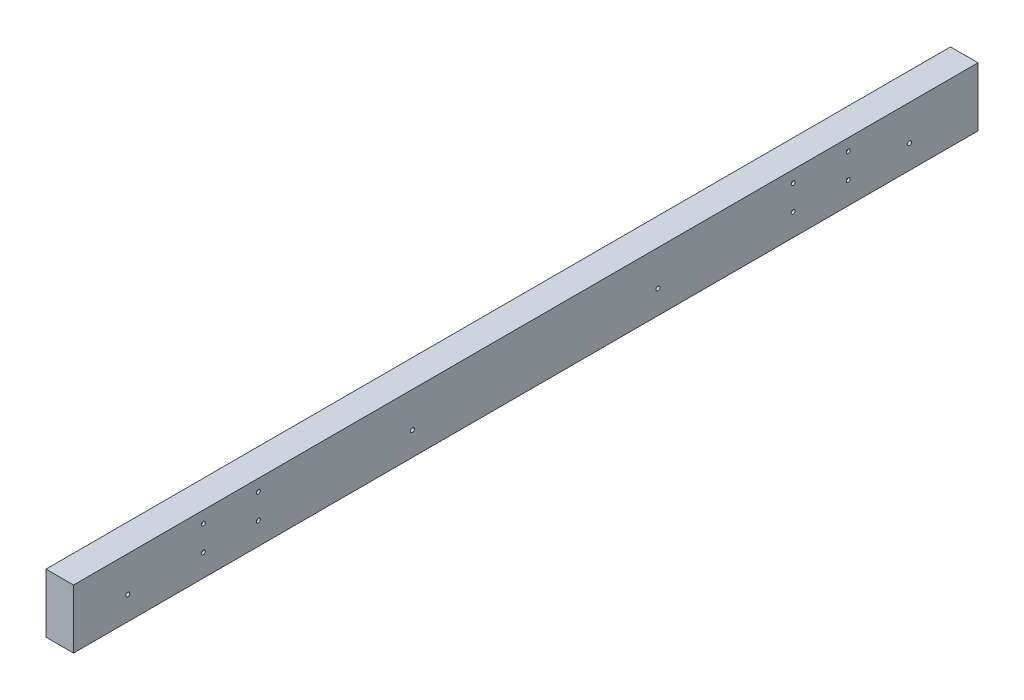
ISO-10303-21;
HEADER;
FILE_DESCRIPTION(('STEP AP214'),'2;1');
FILE_NAME('part.step','',(''),(''),'','','');
FILE_SCHEMA(('AUTOMOTIVE_DESIGN { 1 0 10303 214 1 1 1 1 }'));
ENDSEC;
DATA;
#1=APPLICATION_CONTEXT('core data for automotive mechanical design processes');
#2=APPLICATION_PROTOCOL_DEFINITION('international standard','automotive_design',2000,#1);
#3=PRODUCT_CONTEXT('',#1,'mechanical');
#4=PRODUCT('Part','Part','',(#3));
#5=PRODUCT_RELATED_PRODUCT_CATEGORY('part','',(#4));
#6=PRODUCT_DEFINITION_FORMATION('','',#4);
#7=PRODUCT_DEFINITION_CONTEXT('part definition',#1,'design');
#8=PRODUCT_DEFINITION('design','',#6,#7);
#9=PRODUCT_DEFINITION_SHAPE('','',#8);
#10=(LENGTH_UNIT() NAMED_UNIT(*) SI_UNIT(.MILLI.,.METRE.));
#11=(NAMED_UNIT(*) PLANE_ANGLE_UNIT() SI_UNIT($,.RADIAN.));
#12=(NAMED_UNIT(*) SI_UNIT($,.STERADIAN.) SOLID_ANGLE_UNIT());
#13=UNCERTAINTY_MEASURE_WITH_UNIT(LENGTH_MEASURE(1.E-05),#10,'distance_accuracy_value','');
#14=(GEOMETRIC_REPRESENTATION_CONTEXT(3) GLOBAL_UNCERTAINTY_ASSIGNED_CONTEXT((#13)) GLOBAL_UNIT_ASSIGNED_CONTEXT((#10,
#11,#12)) REPRESENTATION_CONTEXT('',''));
#15=CARTESIAN_POINT('',(0.,0.,0.));
#16=DIRECTION('',(0.,0.,1.));
#17=DIRECTION('',(1.,0.,0.));
#18=AXIS2_PLACEMENT_3D('',#15,#16,#17);
#19=CARTESIAN_POINT('',(-1.524,2.23221198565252,-483.155377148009));
#20=DIRECTION('',(1.,0.,0.));
#21=DIRECTION('',(0.,0.,-1.));
#22=AXIS2_PLACEMENT_3D('',#19,#20,#21);
#23=PLANE('',#22);
#24=CARTESIAN_POINT('',(-1.524,2.23221198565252,-483.155377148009));
#25=DIRECTION('',(1.,0.,0.));
#26=DIRECTION('',(0.,0.,-1.));
#27=AXIS2_PLACEMENT_3D('',#24,#25,#26);
#28=CIRCLE('',#27,1.27000000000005);
#29=CARTESIAN_POINT('',(-1.524,2.23221198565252,-484.425377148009));
#30=VERTEX_POINT('',#29);
#31=EDGE_CURVE('E17',#30,#30,#28,.T.);
#32=ORIENTED_EDGE('',*,*,#31,.T.);
#33=EDGE_LOOP('',(#32));
#34=FACE_BOUND('',#33,.T.);
#35=ADVANCED_FACE('F14',(#34),#23,.T.);
#36=CARTESIAN_POINT('',(-1.524,-13.8205880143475,-483.155377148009));
#37=DIRECTION('',(1.,0.,0.));
#38=DIRECTION('',(0.,0.,-1.));
#39=AXIS2_PLACEMENT_3D('',#36,#37,#38);
#40=PLANE('',#39);
#41=CARTESIAN_POINT('',(-1.524,-13.8205880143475,-483.155377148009));
#42=DIRECTION('',(1.,0.,0.));
#43=DIRECTION('',(0.,0.,-1.));
#44=AXIS2_PLACEMENT_3D('',#41,#42,#43);
#45=CIRCLE('',#44,1.27000000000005);
#46=CARTESIAN_POINT('',(-1.524,-13.8205880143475,-484.425377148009));
#47=VERTEX_POINT('',#46);
#48=EDGE_CURVE('E151',#47,#47,#45,.T.);
#49=ORIENTED_EDGE('',*,*,#48,.T.);
#50=EDGE_LOOP('',(#49));
#51=FACE_BOUND('',#50,.T.);
#52=ADVANCED_FACE('F244',(#51),#40,.T.);
#53=CARTESIAN_POINT('',(-1.524,2.23221198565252,-518.715377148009));
#54=DIRECTION('',(1.,0.,0.));
#55=DIRECTION('',(0.,0.,-1.));
#56=AXIS2_PLACEMENT_3D('',#53,#54,#55);
#57=PLANE('',#56);
#58=CARTESIAN_POINT('',(-1.524,2.23221198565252,-518.715377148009));
#59=DIRECTION('',(1.,0.,0.));
#60=DIRECTION('',(0.,0.,-1.));
#61=AXIS2_PLACEMENT_3D('',#58,#59,#60);
#62=CIRCLE('',#61,1.26999999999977);
#63=CARTESIAN_POINT('',(-1.524,2.23221198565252,-519.985377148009));
#64=VERTEX_POINT('',#63);
#65=EDGE_CURVE('E149',#64,#64,#62,.T.);
#66=ORIENTED_EDGE('',*,*,#65,.T.);
#67=EDGE_LOOP('',(#66));
#68=FACE_BOUND('',#67,.T.);
#69=ADVANCED_FACE('F241',(#68),#57,.T.);
#70=CARTESIAN_POINT('',(-1.524,-13.8205880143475,-518.715377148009));
#71=DIRECTION('',(1.,0.,0.));
#72=DIRECTION('',(0.,0.,-1.));
#73=AXIS2_PLACEMENT_3D('',#70,#71,#72);
#74=PLANE('',#73);
#75=CARTESIAN_POINT('',(-1.524,-13.8205880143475,-518.715377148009));
#76=DIRECTION('',(1.,0.,0.));
#77=DIRECTION('',(0.,0.,-1.));
#78=AXIS2_PLACEMENT_3D('',#75,#76,#77);
#79=CIRCLE('',#78,1.26999999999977);
#80=CARTESIAN_POINT('',(-1.524,-13.8205880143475,-519.985377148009));
#81=VERTEX_POINT('',#80);
#82=EDGE_CURVE('E146',#81,#81,#79,.T.);
#83=ORIENTED_EDGE('',*,*,#82,.T.);
#84=EDGE_LOOP('',(#83));
#85=FACE_BOUND('',#84,.T.);
#86=ADVANCED_FACE('F243',(#85),#74,.T.);
#87=CARTESIAN_POINT('',(-1.524,-13.8205880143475,-102.155377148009));
#88=DIRECTION('',(-1.,0.,0.));
#89=DIRECTION('',(0.,0.,1.));
#90=AXIS2_PLACEMENT_3D('',#87,#88,#89);
#91=PLANE('',#90);
#92=CARTESIAN_POINT('',(-1.524,-13.8205880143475,-102.155377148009));
#93=DIRECTION('',(1.,0.,0.));
#94=DIRECTION('',(0.,0.,-1.));
#95=AXIS2_PLACEMENT_3D('',#92,#93,#94);
#96=CIRCLE('',#95,1.27000000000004);
#97=CARTESIAN_POINT('',(-1.524,-13.8205880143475,-103.425377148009));
#98=VERTEX_POINT('',#97);
#99=EDGE_CURVE('E143',#98,#98,#96,.T.);
#100=ORIENTED_EDGE('',*,*,#99,.T.);
#101=EDGE_LOOP('',(#100));
#102=FACE_BOUND('',#101,.T.);
#103=ADVANCED_FACE('F250',(#102),#91,.F.);
#104=CARTESIAN_POINT('',(-1.524,2.23221198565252,-102.155377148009));
#105=DIRECTION('',(-1.,0.,0.));
#106=DIRECTION('',(0.,0.,1.));
#107=AXIS2_PLACEMENT_3D('',#104,#105,#106);
#108=PLANE('',#107);
#109=CARTESIAN_POINT('',(-1.524,2.23221198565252,-102.155377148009));
#110=DIRECTION('',(1.,0.,0.));
#111=DIRECTION('',(0.,0.,-1.));
#112=AXIS2_PLACEMENT_3D('',#109,#110,#111);
#113=CIRCLE('',#112,1.27000000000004);
#114=CARTESIAN_POINT('',(-1.524,2.23221198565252,-103.425377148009));
#115=VERTEX_POINT('',#114);
#116=EDGE_CURVE('E140',#115,#115,#113,.T.);
#117=ORIENTED_EDGE('',*,*,#116,.T.);
#118=EDGE_LOOP('',(#117));
#119=FACE_BOUND('',#118,.T.);
#120=ADVANCED_FACE('F256',(#119),#108,.F.);
#121=CARTESIAN_POINT('',(-1.524,-13.8205880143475,-137.715377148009));
#122=DIRECTION('',(-1.,0.,0.));
#123=DIRECTION('',(0.,0.,1.));
#124=AXIS2_PLACEMENT_3D('',#121,#122,#123);
#125=PLANE('',#124);
#126=CARTESIAN_POINT('',(-1.524,-13.8205880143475,-137.715377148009));
#127=DIRECTION('',(1.,0.,0.));
#128=DIRECTION('',(0.,0.,-1.));
#129=AXIS2_PLACEMENT_3D('',#126,#127,#128);
#130=CIRCLE('',#129,1.26999999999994);
#131=CARTESIAN_POINT('',(-1.524,-13.8205880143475,-138.985377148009));
#132=VERTEX_POINT('',#131);
#133=EDGE_CURVE('E136',#132,#132,#130,.T.);
#134=ORIENTED_EDGE('',*,*,#133,.T.);
#135=EDGE_LOOP('',(#134));
#136=FACE_BOUND('',#135,.T.);
#137=ADVANCED_FACE('F260',(#136),#125,.F.);
#138=CARTESIAN_POINT('',(-1.524,2.23221198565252,-137.715377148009));
#139=DIRECTION('',(-1.,0.,0.));
#140=DIRECTION('',(0.,0.,1.));
#141=AXIS2_PLACEMENT_3D('',#138,#139,#140);
#142=PLANE('',#141);
#143=CARTESIAN_POINT('',(-1.524,2.23221198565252,-137.715377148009));
#144=DIRECTION('',(1.,0.,0.));
#145=DIRECTION('',(0.,0.,-1.));
#146=AXIS2_PLACEMENT_3D('',#143,#144,#145);
#147=CIRCLE('',#146,1.26999999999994);
#148=CARTESIAN_POINT('',(-1.524,2.23221198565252,-138.985377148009));
#149=VERTEX_POINT('',#148);
#150=EDGE_CURVE('E133',#149,#149,#147,.T.);
#151=ORIENTED_EDGE('',*,*,#150,.T.);
#152=EDGE_LOOP('',(#151));
#153=FACE_BOUND('',#152,.T.);
#154=ADVANCED_FACE('F264',(#153),#142,.F.);
#155=CARTESIAN_POINT('',(-9.398,-13.0077880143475,-53.3822214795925));
#156=DIRECTION('',(1.,0.,0.));
#157=DIRECTION('',(0.,0.,-1.));
#158=AXIS2_PLACEMENT_3D('',#155,#156,#157);
#159=PLANE('',#158);
#160=CARTESIAN_POINT('',(-9.398,-13.0077880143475,-53.3822214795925));
#161=DIRECTION('',(1.,0.,0.));
#162=DIRECTION('',(0.,0.,-1.));
#163=AXIS2_PLACEMENT_3D('',#160,#161,#162);
#164=CIRCLE('',#163,1.27000000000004);
#165=CARTESIAN_POINT('',(-9.398,-13.0077880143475,-54.6522214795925));
#166=VERTEX_POINT('',#165);
#167=EDGE_CURVE('E130',#166,#166,#164,.T.);
#168=ORIENTED_EDGE('',*,*,#167,.T.);
#169=EDGE_LOOP('',(#168));
#170=FACE_BOUND('',#169,.T.);
#171=ADVANCED_FACE('F268',(#170),#159,.T.);
#172=CARTESIAN_POINT('',(-9.398,-13.0077880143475,-237.255677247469));
#173=DIRECTION('',(1.,0.,0.));
#174=DIRECTION('',(0.,0.,-1.));
#175=AXIS2_PLACEMENT_3D('',#172,#173,#174);
#176=PLANE('',#175);
#177=CARTESIAN_POINT('',(-9.398,-13.0077880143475,-237.255677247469));
#178=DIRECTION('',(1.,0.,0.));
#179=DIRECTION('',(0.,0.,-1.));
#180=AXIS2_PLACEMENT_3D('',#177,#178,#179);
#181=CIRCLE('',#180,1.27000000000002);
#182=CARTESIAN_POINT('',(-9.398,-13.0077880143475,-238.525677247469));
#183=VERTEX_POINT('',#182);
#184=EDGE_CURVE('E126',#183,#183,#181,.T.);
#185=ORIENTED_EDGE('',*,*,#184,.T.);
#186=EDGE_LOOP('',(#185));
#187=FACE_BOUND('',#186,.T.);
#188=ADVANCED_FACE('F272',(#187),#176,.T.);
#189=CARTESIAN_POINT('',(-9.398,-13.0077880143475,-395.847990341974));
#190=DIRECTION('',(1.,0.,0.));
#191=DIRECTION('',(0.,0.,-1.));
#192=AXIS2_PLACEMENT_3D('',#189,#190,#191);
#193=PLANE('',#192);
#194=CARTESIAN_POINT('',(-9.398,-13.0077880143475,-395.847990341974));
#195=DIRECTION('',(1.,0.,0.));
#196=DIRECTION('',(0.,0.,-1.));
#197=AXIS2_PLACEMENT_3D('',#194,#195,#196);
#198=CIRCLE('',#197,1.27000000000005);
#199=CARTESIAN_POINT('',(-9.398,-13.0077880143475,-397.117990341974));
#200=VERTEX_POINT('',#199);
#201=EDGE_CURVE('E123',#200,#200,#198,.T.);
#202=ORIENTED_EDGE('',*,*,#201,.T.);
#203=EDGE_LOOP('',(#202));
#204=FACE_BOUND('',#203,.T.);
#205=ADVANCED_FACE('F173',(#204),#193,.T.);
#206=CARTESIAN_POINT('',(-9.398,-13.0077880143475,-558.321720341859));
#207=DIRECTION('',(1.,0.,0.));
#208=DIRECTION('',(0.,0.,-1.));
#209=AXIS2_PLACEMENT_3D('',#206,#207,#208);
#210=PLANE('',#209);
#211=CARTESIAN_POINT('',(-9.398,-13.0077880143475,-558.321720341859));
#212=DIRECTION('',(1.,0.,0.));
#213=DIRECTION('',(0.,0.,-1.));
#214=AXIS2_PLACEMENT_3D('',#211,#212,#213);
#215=CIRCLE('',#214,1.26999999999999);
#216=CARTESIAN_POINT('',(-9.398,-13.0077880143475,-559.591720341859));
#217=VERTEX_POINT('',#216);
#218=EDGE_CURVE('E119',#217,#217,#215,.T.);
#219=ORIENTED_EDGE('',*,*,#218,.T.);
#220=EDGE_LOOP('',(#219));
#221=FACE_BOUND('',#220,.T.);
#222=ADVANCED_FACE('F162',(#221),#210,.T.);
#223=CARTESIAN_POINT('',(-1.524,2.23221198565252,-483.155377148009));
#224=DIRECTION('',(1.,0.,0.));
#225=DIRECTION('',(0.,0.,-1.));
#226=AXIS2_PLACEMENT_3D('',#223,#224,#225);
#227=CYLINDRICAL_SURFACE('',#226,1.27000000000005);
#228=CARTESIAN_POINT('',(0.,2.23221198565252,-483.155377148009));
#229=DIRECTION('',(1.,0.,0.));
#230=DIRECTION('',(0.,0.,-1.));
#231=AXIS2_PLACEMENT_3D('',#228,#229,#230);
#232=CIRCLE('',#231,1.27000000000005);
#233=CARTESIAN_POINT('',(0.,2.23221198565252,-484.425377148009));
#234=VERTEX_POINT('',#233);
#235=EDGE_CURVE('E116',#234,#234,#232,.T.);
#236=ORIENTED_EDGE('',*,*,#235,.T.);
#237=EDGE_LOOP('',(#236));
#238=FACE_BOUND('',#237,.T.);
#239=ORIENTED_EDGE('',*,*,#31,.F.);
#240=EDGE_LOOP('',(#239));
#241=FACE_BOUND('',#240,.T.);
#242=ADVANCED_FACE('F159',(#238,#241),#227,.F.);
#243=CARTESIAN_POINT('',(-1.524,-13.8205880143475,-483.155377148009));
#244=DIRECTION('',(1.,0.,0.));
#245=DIRECTION('',(0.,0.,-1.));
#246=AXIS2_PLACEMENT_3D('',#243,#244,#245);
#247=CYLINDRICAL_SURFACE('',#246,1.27000000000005);
#248=CARTESIAN_POINT('',(0.,-13.8205880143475,-483.155377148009));
#249=DIRECTION('',(1.,0.,0.));
#250=DIRECTION('',(0.,0.,-1.));
#251=AXIS2_PLACEMENT_3D('',#248,#249,#250);
#252=CIRCLE('',#251,1.27000000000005);
#253=CARTESIAN_POINT('',(0.,-13.8205880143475,-484.425377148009));
#254=VERTEX_POINT('',#253);
#255=EDGE_CURVE('E113',#254,#254,#252,.T.);
#256=ORIENTED_EDGE('',*,*,#255,.T.);
#257=EDGE_LOOP('',(#256));
#258=FACE_BOUND('',#257,.T.);
#259=ORIENTED_EDGE('',*,*,#48,.F.);
#260=EDGE_LOOP('',(#259));
#261=FACE_BOUND('',#260,.T.);
#262=ADVANCED_FACE('F161',(#258,#261),#247,.F.);
#263=CARTESIAN_POINT('',(-1.524,2.23221198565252,-518.715377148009));
#264=DIRECTION('',(1.,0.,0.));
#265=DIRECTION('',(0.,0.,-1.));
#266=AXIS2_PLACEMENT_3D('',#263,#264,#265);
#267=CYLINDRICAL_SURFACE('',#266,1.26999999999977);
#268=CARTESIAN_POINT('',(0.,2.23221198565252,-518.715377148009));
#269=DIRECTION('',(1.,0.,0.));
#270=DIRECTION('',(0.,0.,-1.));
#271=AXIS2_PLACEMENT_3D('',#268,#269,#270);
#272=CIRCLE('',#271,1.26999999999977);
#273=CARTESIAN_POINT('',(0.,2.23221198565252,-519.985377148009));
#274=VERTEX_POINT('',#273);
#275=EDGE_CURVE('E110',#274,#274,#272,.T.);
#276=ORIENTED_EDGE('',*,*,#275,.T.);
#277=EDGE_LOOP('',(#276));
#278=FACE_BOUND('',#277,.T.);
#279=ORIENTED_EDGE('',*,*,#65,.F.);
#280=EDGE_LOOP('',(#279));
#281=FACE_BOUND('',#280,.T.);
#282=ADVANCED_FACE('F170',(#278,#281),#267,.F.);
#283=CARTESIAN_POINT('',(-1.524,-13.8205880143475,-518.715377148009));
#284=DIRECTION('',(1.,0.,0.));
#285=DIRECTION('',(0.,0.,-1.));
#286=AXIS2_PLACEMENT_3D('',#283,#284,#285);
#287=CYLINDRICAL_SURFACE('',#286,1.26999999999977);
#288=CARTESIAN_POINT('',(0.,-13.8205880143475,-518.715377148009));
#289=DIRECTION('',(1.,0.,0.));
#290=DIRECTION('',(0.,0.,-1.));
#291=AXIS2_PLACEMENT_3D('',#288,#289,#290);
#292=CIRCLE('',#291,1.26999999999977);
#293=CARTESIAN_POINT('',(0.,-13.8205880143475,-519.985377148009));
#294=VERTEX_POINT('',#293);
#295=EDGE_CURVE('E107',#294,#294,#292,.T.);
#296=ORIENTED_EDGE('',*,*,#295,.T.);
#297=EDGE_LOOP('',(#296));
#298=FACE_BOUND('',#297,.T.);
#299=ORIENTED_EDGE('',*,*,#82,.F.);
#300=EDGE_LOOP('',(#299));
#301=FACE_BOUND('',#300,.T.);
#302=ADVANCED_FACE('F228',(#298,#301),#287,.F.);
#303=CARTESIAN_POINT('',(-1.524,-13.8205880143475,-102.155377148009));
#304=DIRECTION('',(1.,0.,0.));
#305=DIRECTION('',(0.,0.,-1.));
#306=AXIS2_PLACEMENT_3D('',#303,#304,#305);
#307=CYLINDRICAL_SURFACE('',#306,1.27000000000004);
#308=CARTESIAN_POINT('',(0.,-13.8205880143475,-102.155377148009));
#309=DIRECTION('',(1.,0.,0.));
#310=DIRECTION('',(0.,0.,-1.));
#311=AXIS2_PLACEMENT_3D('',#308,#309,#310);
#312=CIRCLE('',#311,1.27000000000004);
#313=CARTESIAN_POINT('',(0.,-13.8205880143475,-103.425377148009));
#314=VERTEX_POINT('',#313);
#315=EDGE_CURVE('E104',#314,#314,#312,.T.);
#316=ORIENTED_EDGE('',*,*,#315,.T.);
#317=EDGE_LOOP('',(#316));
#318=FACE_BOUND('',#317,.T.);
#319=ORIENTED_EDGE('',*,*,#99,.F.);
#320=EDGE_LOOP('',(#319));
#321=FACE_BOUND('',#320,.T.);
#322=ADVANCED_FACE('F224',(#318,#321),#307,.F.);
#323=CARTESIAN_POINT('',(-1.524,2.23221198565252,-102.155377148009));
#324=DIRECTION('',(1.,0.,0.));
#325=DIRECTION('',(0.,0.,-1.));
#326=AXIS2_PLACEMENT_3D('',#323,#324,#325);
#327=CYLINDRICAL_SURFACE('',#326,1.27000000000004);
#328=CARTESIAN_POINT('',(0.,2.23221198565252,-102.155377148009));
#329=DIRECTION('',(1.,0.,0.));
#330=DIRECTION('',(0.,0.,-1.));
#331=AXIS2_PLACEMENT_3D('',#328,#329,#330);
#332=CIRCLE('',#331,1.27000000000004);
#333=CARTESIAN_POINT('',(0.,2.23221198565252,-103.425377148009));
#334=VERTEX_POINT('',#333);
#335=EDGE_CURVE('E101',#334,#334,#332,.T.);
#336=ORIENTED_EDGE('',*,*,#335,.T.);
#337=EDGE_LOOP('',(#336));
#338=FACE_BOUND('',#337,.T.);
#339=ORIENTED_EDGE('',*,*,#116,.F.);
#340=EDGE_LOOP('',(#339));
#341=FACE_BOUND('',#340,.T.);
#342=ADVANCED_FACE('F220',(#338,#341),#327,.F.);
#343=CARTESIAN_POINT('',(-1.524,-13.8205880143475,-137.715377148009));
#344=DIRECTION('',(1.,0.,0.));
#345=DIRECTION('',(0.,0.,-1.));
#346=AXIS2_PLACEMENT_3D('',#343,#344,#345);
#347=CYLINDRICAL_SURFACE('',#346,1.26999999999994);
#348=CARTESIAN_POINT('',(0.,-13.8205880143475,-137.715377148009));
#349=DIRECTION('',(1.,0.,0.));
#350=DIRECTION('',(0.,0.,-1.));
#351=AXIS2_PLACEMENT_3D('',#348,#349,#350);
#352=CIRCLE('',#351,1.26999999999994);
#353=CARTESIAN_POINT('',(0.,-13.8205880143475,-138.985377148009));
#354=VERTEX_POINT('',#353);
#355=EDGE_CURVE('E97',#354,#354,#352,.T.);
#356=ORIENTED_EDGE('',*,*,#355,.T.);
#357=EDGE_LOOP('',(#356));
#358=FACE_BOUND('',#357,.T.);
#359=ORIENTED_EDGE('',*,*,#133,.F.);
#360=EDGE_LOOP('',(#359));
#361=FACE_BOUND('',#360,.T.);
#362=ADVANCED_FACE('F216',(#358,#361),#347,.F.);
#363=CARTESIAN_POINT('',(-1.524,2.23221198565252,-137.715377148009));
#364=DIRECTION('',(1.,0.,0.));
#365=DIRECTION('',(0.,0.,-1.));
#366=AXIS2_PLACEMENT_3D('',#363,#364,#365);
#367=CYLINDRICAL_SURFACE('',#366,1.26999999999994);
#368=CARTESIAN_POINT('',(0.,2.23221198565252,-137.715377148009));
#369=DIRECTION('',(1.,0.,0.));
#370=DIRECTION('',(0.,0.,-1.));
#371=AXIS2_PLACEMENT_3D('',#368,#369,#370);
#372=CIRCLE('',#371,1.26999999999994);
#373=CARTESIAN_POINT('',(0.,2.23221198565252,-138.985377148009));
#374=VERTEX_POINT('',#373);
#375=EDGE_CURVE('E94',#374,#374,#372,.T.);
#376=ORIENTED_EDGE('',*,*,#375,.T.);
#377=EDGE_LOOP('',(#376));
#378=FACE_BOUND('',#377,.T.);
#379=ORIENTED_EDGE('',*,*,#150,.F.);
#380=EDGE_LOOP('',(#379));
#381=FACE_BOUND('',#380,.T.);
#382=ADVANCED_FACE('F212',(#378,#381),#367,.F.);
#383=CARTESIAN_POINT('',(-9.398,-13.0077880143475,-53.3822214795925));
#384=DIRECTION('',(1.,0.,0.));
#385=DIRECTION('',(0.,0.,-1.));
#386=AXIS2_PLACEMENT_3D('',#383,#384,#385);
#387=CYLINDRICAL_SURFACE('',#386,1.27000000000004);
#388=CARTESIAN_POINT('',(0.,-13.0077880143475,-53.3822214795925));
#389=DIRECTION('',(1.,0.,0.));
#390=DIRECTION('',(0.,0.,-1.));
#391=AXIS2_PLACEMENT_3D('',#388,#389,#390);
#392=CIRCLE('',#391,1.27000000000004);
#393=CARTESIAN_POINT('',(0.,-13.0077880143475,-54.6522214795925));
#394=VERTEX_POINT('',#393);
#395=EDGE_CURVE('E91',#394,#394,#392,.T.);
#396=ORIENTED_EDGE('',*,*,#395,.T.);
#397=EDGE_LOOP('',(#396));
#398=FACE_BOUND('',#397,.T.);
#399=ORIENTED_EDGE('',*,*,#167,.F.);
#400=EDGE_LOOP('',(#399));
#401=FACE_BOUND('',#400,.T.);
#402=ADVANCED_FACE('F208',(#398,#401),#387,.F.);
#403=CARTESIAN_POINT('',(-9.398,-13.0077880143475,-237.255677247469));
#404=DIRECTION('',(1.,0.,0.));
#405=DIRECTION('',(0.,0.,-1.));
#406=AXIS2_PLACEMENT_3D('',#403,#404,#405);
#407=CYLINDRICAL_SURFACE('',#406,1.27000000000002);
#408=CARTESIAN_POINT('',(0.,-13.0077880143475,-237.255677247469));
#409=DIRECTION('',(1.,0.,0.));
#410=DIRECTION('',(0.,0.,-1.));
#411=AXIS2_PLACEMENT_3D('',#408,#409,#410);
#412=CIRCLE('',#411,1.27000000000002);
#413=CARTESIAN_POINT('',(0.,-13.0077880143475,-238.525677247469));
#414=VERTEX_POINT('',#413);
#415=EDGE_CURVE('E87',#414,#414,#412,.T.);
#416=ORIENTED_EDGE('',*,*,#415,.T.);
#417=EDGE_LOOP('',(#416));
#418=FACE_BOUND('',#417,.T.);
#419=ORIENTED_EDGE('',*,*,#184,.F.);
#420=EDGE_LOOP('',(#419));
#421=FACE_BOUND('',#420,.T.);
#422=ADVANCED_FACE('F204',(#418,#421),#407,.F.);
#423=CARTESIAN_POINT('',(-9.398,-13.0077880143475,-395.847990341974));
#424=DIRECTION('',(1.,0.,0.));
#425=DIRECTION('',(0.,0.,-1.));
#426=AXIS2_PLACEMENT_3D('',#423,#424,#425);
#427=CYLINDRICAL_SURFACE('',#426,1.27000000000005);
#428=CARTESIAN_POINT('',(0.,-13.0077880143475,-395.847990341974));
#429=DIRECTION('',(1.,0.,0.));
#430=DIRECTION('',(0.,0.,-1.));
#431=AXIS2_PLACEMENT_3D('',#428,#429,#430);
#432=CIRCLE('',#431,1.27000000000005);
#433=CARTESIAN_POINT('',(0.,-13.0077880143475,-397.117990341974));
#434=VERTEX_POINT('',#433);
#435=EDGE_CURVE('E84',#434,#434,#432,.T.);
#436=ORIENTED_EDGE('',*,*,#435,.T.);
#437=EDGE_LOOP('',(#436));
#438=FACE_BOUND('',#437,.T.);
#439=ORIENTED_EDGE('',*,*,#201,.F.);
#440=EDGE_LOOP('',(#439));
#441=FACE_BOUND('',#440,.T.);
#442=ADVANCED_FACE('F200',(#438,#441),#427,.F.);
#443=CARTESIAN_POINT('',(-9.398,-13.0077880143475,-558.321720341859));
#444=DIRECTION('',(1.,0.,0.));
#445=DIRECTION('',(0.,0.,-1.));
#446=AXIS2_PLACEMENT_3D('',#443,#444,#445);
#447=CYLINDRICAL_SURFACE('',#446,1.26999999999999);
#448=CARTESIAN_POINT('',(0.,-13.0077880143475,-558.321720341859));
#449=DIRECTION('',(1.,0.,0.));
#450=DIRECTION('',(0.,0.,-1.));
#451=AXIS2_PLACEMENT_3D('',#448,#449,#450);
#452=CIRCLE('',#451,1.26999999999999);
#453=CARTESIAN_POINT('',(0.,-13.0077880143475,-559.591720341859));
#454=VERTEX_POINT('',#453);
#455=EDGE_CURVE('E66',#454,#454,#452,.T.);
#456=ORIENTED_EDGE('',*,*,#455,.T.);
#457=EDGE_LOOP('',(#456));
#458=FACE_BOUND('',#457,.T.);
#459=ORIENTED_EDGE('',*,*,#218,.F.);
#460=EDGE_LOOP('',(#459));
#461=FACE_BOUND('',#460,.T.);
#462=ADVANCED_FACE('F197',(#458,#461),#447,.F.);
#463=CARTESIAN_POINT('',(0.,0.,0.));
#464=DIRECTION('',(-1.,0.,0.));
#465=DIRECTION('',(0.,0.,1.));
#466=AXIS2_PLACEMENT_3D('',#463,#464,#465);
#467=PLANE('',#466);
#468=DIRECTION('',(0.,1.,0.));
#469=VECTOR('',#468,1.);
#470=CARTESIAN_POINT('',(0.,0.,-602.535377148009));
#471=LINE('',#470,#469);
#472=CARTESIAN_POINT('',(0.,-28.2477880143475,-602.535377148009));
#473=VERTEX_POINT('',#472);
#474=CARTESIAN_POINT('',(0.,9.85221198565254,-602.535377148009));
#475=VERTEX_POINT('',#474);
#476=EDGE_CURVE('E449',#473,#475,#471,.T.);
#477=ORIENTED_EDGE('',*,*,#476,.T.);
#478=DIRECTION('',(0.,0.,1.));
#479=VECTOR('',#478,1.);
#480=CARTESIAN_POINT('',(0.,9.85221198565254,0.));
#481=LINE('',#480,#479);
#482=CARTESIAN_POINT('',(0.,9.85221198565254,-18.3353771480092));
#483=VERTEX_POINT('',#482);
#484=EDGE_CURVE('E52',#483,#475,#481,.F.);
#485=ORIENTED_EDGE('',*,*,#484,.F.);
#486=DIRECTION('',(0.,1.,0.));
#487=VECTOR('',#486,1.);
#488=CARTESIAN_POINT('',(0.,0.,-18.3353771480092));
#489=LINE('',#488,#487);
#490=CARTESIAN_POINT('',(0.,-28.2477880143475,-18.3353771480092));
#491=VERTEX_POINT('',#490);
#492=EDGE_CURVE('E68',#483,#491,#489,.F.);
#493=ORIENTED_EDGE('',*,*,#492,.T.);
#494=DIRECTION('',(0.,0.,1.));
#495=VECTOR('',#494,1.);
#496=CARTESIAN_POINT('',(0.,-28.2477880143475,0.));
#497=LINE('',#496,#495);
#498=EDGE_CURVE('E57',#491,#473,#497,.F.);
#499=ORIENTED_EDGE('',*,*,#498,.T.);
#500=EDGE_LOOP('',(#477,#485,#493,#499));
#501=FACE_BOUND('',#500,.T.);
#502=ORIENTED_EDGE('',*,*,#455,.F.);
#503=EDGE_LOOP('',(#502));
#504=FACE_BOUND('',#503,.T.);
#505=ORIENTED_EDGE('',*,*,#435,.F.);
#506=EDGE_LOOP('',(#505));
#507=FACE_BOUND('',#506,.T.);
#508=ORIENTED_EDGE('',*,*,#415,.F.);
#509=EDGE_LOOP('',(#508));
#510=FACE_BOUND('',#509,.T.);
#511=ORIENTED_EDGE('',*,*,#395,.F.);
#512=EDGE_LOOP('',(#511));
#513=FACE_BOUND('',#512,.T.);
#514=ORIENTED_EDGE('',*,*,#375,.F.);
#515=EDGE_LOOP('',(#514));
#516=FACE_BOUND('',#515,.T.);
#517=ORIENTED_EDGE('',*,*,#355,.F.);
#518=EDGE_LOOP('',(#517));
#519=FACE_BOUND('',#518,.T.);
#520=ORIENTED_EDGE('',*,*,#335,.F.);
#521=EDGE_LOOP('',(#520));
#522=FACE_BOUND('',#521,.T.);
#523=ORIENTED_EDGE('',*,*,#315,.F.);
#524=EDGE_LOOP('',(#523));
#525=FACE_BOUND('',#524,.T.);
#526=ORIENTED_EDGE('',*,*,#295,.F.);
#527=EDGE_LOOP('',(#526));
#528=FACE_BOUND('',#527,.T.);
#529=ORIENTED_EDGE('',*,*,#275,.F.);
#530=EDGE_LOOP('',(#529));
#531=FACE_BOUND('',#530,.T.);
#532=ORIENTED_EDGE('',*,*,#255,.F.);
#533=EDGE_LOOP('',(#532));
#534=FACE_BOUND('',#533,.T.);
#535=ORIENTED_EDGE('',*,*,#235,.F.);
#536=EDGE_LOOP('',(#535));
#537=FACE_BOUND('',#536,.T.);
#538=ADVANCED_FACE('F69',(#501,#504,#507,#510,#513,#516,#519,#522,#525,#528,#531,#534,#537),
#467,.F.);
#539=CARTESIAN_POINT('',(-17.78,-28.2477880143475,0.));
#540=DIRECTION('',(0.,1.,0.));
#541=DIRECTION('',(0.,0.,1.));
#542=AXIS2_PLACEMENT_3D('',#539,#540,#541);
#543=PLANE('',#542);
#544=DIRECTION('',(1.,0.,0.));
#545=VECTOR('',#544,1.);
#546=CARTESIAN_POINT('',(-17.78,-28.2477880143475,-18.3353771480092));
#547=LINE('',#546,#545);
#548=CARTESIAN_POINT('',(-17.78,-28.2477880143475,-18.3353771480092));
#549=VERTEX_POINT('',#548);
#550=EDGE_CURVE('E60',#491,#549,#547,.F.);
#551=ORIENTED_EDGE('',*,*,#550,.T.);
#552=DIRECTION('',(0.,0.,1.));
#553=VECTOR('',#552,1.);
#554=CARTESIAN_POINT('',(-17.78,-28.2477880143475,0.));
#555=LINE('',#554,#553);
#556=CARTESIAN_POINT('',(-17.78,-28.2477880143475,-602.535377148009));
#557=VERTEX_POINT('',#556);
#558=EDGE_CURVE('E446',#557,#549,#555,.T.);
#559=ORIENTED_EDGE('',*,*,#558,.F.);
#560=DIRECTION('',(1.,0.,0.));
#561=VECTOR('',#560,1.);
#562=CARTESIAN_POINT('',(-17.78,-28.2477880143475,-602.535377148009));
#563=LINE('',#562,#561);
#564=EDGE_CURVE('E63',#557,#473,#563,.T.);
#565=ORIENTED_EDGE('',*,*,#564,.T.);
#566=ORIENTED_EDGE('',*,*,#498,.F.);
#567=EDGE_LOOP('',(#551,#559,#565,#566));
#568=FACE_BOUND('',#567,.T.);
#569=ADVANCED_FACE('F58',(#568),#543,.F.);
#570=CARTESIAN_POINT('',(-17.78,0.,-18.3353771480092));
#571=DIRECTION('',(0.,0.,-1.));
#572=DIRECTION('',(0.,1.,0.));
#573=AXIS2_PLACEMENT_3D('',#570,#571,#572);
#574=PLANE('',#573);
#575=DIRECTION('',(1.,0.,0.));
#576=VECTOR('',#575,1.);
#577=CARTESIAN_POINT('',(-17.78,9.85221198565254,-18.3353771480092));
#578=LINE('',#577,#576);
#579=CARTESIAN_POINT('',(-17.78,9.85221198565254,-18.3353771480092));
#580=VERTEX_POINT('',#579);
#581=EDGE_CURVE('E443',#580,#483,#578,.T.);
#582=ORIENTED_EDGE('',*,*,#581,.F.);
#583=DIRECTION('',(0.,1.,0.));
#584=VECTOR('',#583,1.);
#585=CARTESIAN_POINT('',(-17.78,0.,-18.3353771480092));
#586=LINE('',#585,#584);
#587=EDGE_CURVE('E76',#549,#580,#586,.T.);
#588=ORIENTED_EDGE('',*,*,#587,.F.);
#589=ORIENTED_EDGE('',*,*,#550,.F.);
#590=ORIENTED_EDGE('',*,*,#492,.F.);
#591=EDGE_LOOP('',(#582,#588,#589,#590));
#592=FACE_BOUND('',#591,.T.);
#593=ADVANCED_FACE('F74',(#592),#574,.F.);
#594=CARTESIAN_POINT('',(-17.78,9.85221198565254,0.));
#595=DIRECTION('',(0.,1.,0.));
#596=DIRECTION('',(0.,0.,1.));
#597=AXIS2_PLACEMENT_3D('',#594,#595,#596);
#598=PLANE('',#597);
#599=DIRECTION('',(0.,0.,1.));
#600=VECTOR('',#599,1.);
#601=CARTESIAN_POINT('',(-17.78,9.85221198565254,0.));
#602=LINE('',#601,#600);
#603=CARTESIAN_POINT('',(-17.78,9.85221198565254,-602.535377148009));
#604=VERTEX_POINT('',#603);
#605=EDGE_CURVE('E23',#580,#604,#602,.F.);
#606=ORIENTED_EDGE('',*,*,#605,.F.);
#607=ORIENTED_EDGE('',*,*,#581,.T.);
#608=ORIENTED_EDGE('',*,*,#484,.T.);
#609=DIRECTION('',(1.,0.,0.));
#610=VECTOR('',#609,1.);
#611=CARTESIAN_POINT('',(-17.78,9.85221198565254,-602.535377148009));
#612=LINE('',#611,#610);
#613=EDGE_CURVE('E32',#475,#604,#612,.F.);
#614=ORIENTED_EDGE('',*,*,#613,.T.);
#615=EDGE_LOOP('',(#606,#607,#608,#614));
#616=FACE_BOUND('',#615,.T.);
#617=ADVANCED_FACE('F185',(#616),#598,.T.);
#618=CARTESIAN_POINT('',(-17.78,0.,-602.535377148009));
#619=DIRECTION('',(0.,0.,1.));
#620=DIRECTION('',(1.,0.,0.));
#621=AXIS2_PLACEMENT_3D('',#618,#619,#620);
#622=PLANE('',#621);
#623=ORIENTED_EDGE('',*,*,#564,.F.);
#624=DIRECTION('',(0.,1.,0.));
#625=VECTOR('',#624,1.);
#626=CARTESIAN_POINT('',(-17.78,0.,-602.535377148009));
#627=LINE('',#626,#625);
#628=EDGE_CURVE('E9',#604,#557,#627,.F.);
#629=ORIENTED_EDGE('',*,*,#628,.F.);
#630=ORIENTED_EDGE('',*,*,#613,.F.);
#631=ORIENTED_EDGE('',*,*,#476,.F.);
#632=EDGE_LOOP('',(#623,#629,#630,#631));
#633=FACE_BOUND('',#632,.T.);
#634=ADVANCED_FACE('F178',(#633),#622,.F.);
#635=CARTESIAN_POINT('',(-17.78,0.,0.));
#636=DIRECTION('',(-1.,0.,0.));
#637=DIRECTION('',(0.,0.,1.));
#638=AXIS2_PLACEMENT_3D('',#635,#636,#637);
#639=PLANE('',#638);
#640=ORIENTED_EDGE('',*,*,#605,.T.);
#641=ORIENTED_EDGE('',*,*,#628,.T.);
#642=ORIENTED_EDGE('',*,*,#558,.T.);
#643=ORIENTED_EDGE('',*,*,#587,.T.);
#644=EDGE_LOOP('',(#640,#641,#642,#643));
#645=FACE_BOUND('',#644,.T.);
#646=ADVANCED_FACE('F176',(#645),#639,.T.);
#647=CLOSED_SHELL('',(#35,#52,#69,#86,#103,#120,#137,#154,#171,#188,#205,#222,#242,#262,#282,
#302,#322,#342,#362,#382,#402,#422,#442,#462,#538,#569,#593,#617,#634,#646));
#648=MANIFOLD_SOLID_BREP('B1',#647);
#649=ADVANCED_BREP_SHAPE_REPRESENTATION('',(#18,#648),#14);
#650=SHAPE_DEFINITION_REPRESENTATION(#9,#649);
ENDSEC;
END-ISO-10303-21;
